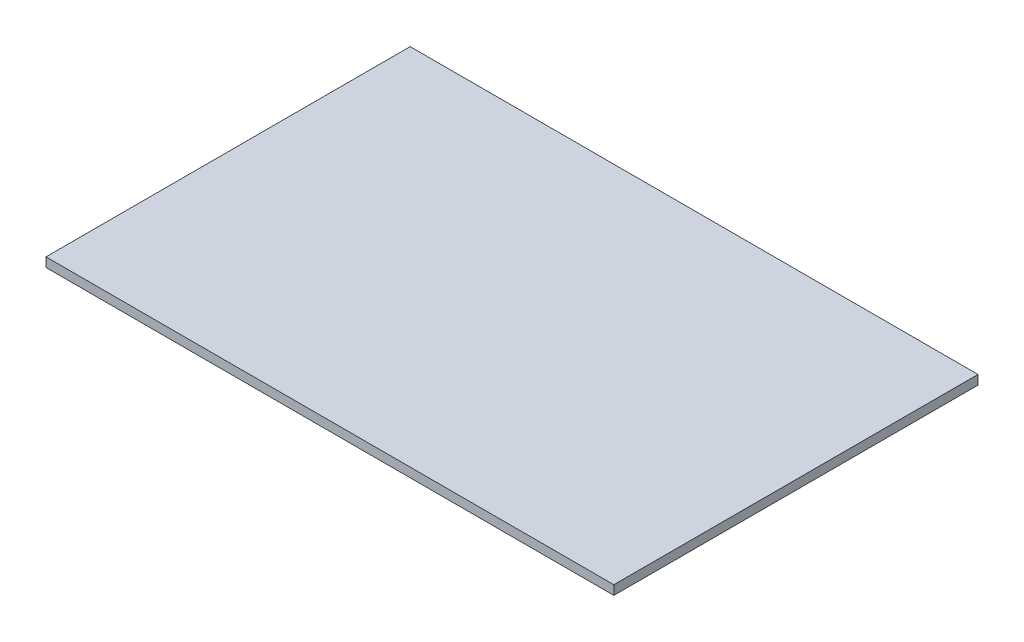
ISO-10303-21;
HEADER;
FILE_DESCRIPTION(('STEP AP214'),'2;1');
FILE_NAME('part.step','',(''),(''),'','','');
FILE_SCHEMA(('AUTOMOTIVE_DESIGN { 1 0 10303 214 1 1 1 1 }'));
ENDSEC;
DATA;
#1=APPLICATION_CONTEXT('core data for automotive mechanical design processes');
#2=APPLICATION_PROTOCOL_DEFINITION('international standard','automotive_design',2000,#1);
#3=PRODUCT_CONTEXT('',#1,'mechanical');
#4=PRODUCT('Part','Part','',(#3));
#5=PRODUCT_RELATED_PRODUCT_CATEGORY('part','',(#4));
#6=PRODUCT_DEFINITION_FORMATION('','',#4);
#7=PRODUCT_DEFINITION_CONTEXT('part definition',#1,'design');
#8=PRODUCT_DEFINITION('design','',#6,#7);
#9=PRODUCT_DEFINITION_SHAPE('','',#8);
#10=(LENGTH_UNIT() NAMED_UNIT(*) SI_UNIT(.MILLI.,.METRE.));
#11=(NAMED_UNIT(*) PLANE_ANGLE_UNIT() SI_UNIT($,.RADIAN.));
#12=(NAMED_UNIT(*) SI_UNIT($,.STERADIAN.) SOLID_ANGLE_UNIT());
#13=UNCERTAINTY_MEASURE_WITH_UNIT(LENGTH_MEASURE(1.E-05),#10,'distance_accuracy_value','');
#14=(GEOMETRIC_REPRESENTATION_CONTEXT(3) GLOBAL_UNCERTAINTY_ASSIGNED_CONTEXT((#13)) GLOBAL_UNIT_ASSIGNED_CONTEXT((#10,
#11,#12)) REPRESENTATION_CONTEXT('',''));
#15=CARTESIAN_POINT('',(0.,0.,0.));
#16=DIRECTION('',(0.,0.,1.));
#17=DIRECTION('',(1.,0.,0.));
#18=AXIS2_PLACEMENT_3D('',#15,#16,#17);
#19=CARTESIAN_POINT('',(0.,19.05,0.));
#20=DIRECTION('',(1.,0.,0.));
#21=DIRECTION('',(0.,0.,-1.));
#22=AXIS2_PLACEMENT_3D('',#19,#20,#21);
#23=PLANE('',#22);
#24=DIRECTION('',(0.,0.,1.));
#25=VECTOR('',#24,1.);
#26=CARTESIAN_POINT('',(0.,0.,0.));
#27=LINE('',#26,#25);
#28=CARTESIAN_POINT('',(0.,0.,-749.3));
#29=VERTEX_POINT('',#28);
#30=CARTESIAN_POINT('',(0.,0.,0.));
#31=VERTEX_POINT('',#30);
#32=EDGE_CURVE('E102',#29,#31,#27,.T.);
#33=ORIENTED_EDGE('',*,*,#32,.T.);
#34=DIRECTION('',(0.,-1.,0.));
#35=VECTOR('',#34,1.);
#36=CARTESIAN_POINT('',(0.,19.05,0.));
#37=LINE('',#36,#35);
#38=CARTESIAN_POINT('',(0.,19.05,0.));
#39=VERTEX_POINT('',#38);
#40=EDGE_CURVE('E11',#39,#31,#37,.T.);
#41=ORIENTED_EDGE('',*,*,#40,.F.);
#42=DIRECTION('',(0.,0.,1.));
#43=VECTOR('',#42,1.);
#44=CARTESIAN_POINT('',(0.,19.05,0.));
#45=LINE('',#44,#43);
#46=CARTESIAN_POINT('',(0.,19.05,-749.3));
#47=VERTEX_POINT('',#46);
#48=EDGE_CURVE('E90',#47,#39,#45,.T.);
#49=ORIENTED_EDGE('',*,*,#48,.F.);
#50=DIRECTION('',(0.,-1.,0.));
#51=VECTOR('',#50,1.);
#52=CARTESIAN_POINT('',(0.,19.05,-749.3));
#53=LINE('',#52,#51);
#54=EDGE_CURVE('E98',#47,#29,#53,.T.);
#55=ORIENTED_EDGE('',*,*,#54,.T.);
#56=EDGE_LOOP('',(#33,#41,#49,#55));
#57=FACE_BOUND('',#56,.T.);
#58=ADVANCED_FACE('F39',(#57),#23,.F.);
#59=CARTESIAN_POINT('',(0.,19.05,0.));
#60=DIRECTION('',(0.,0.,-1.));
#61=DIRECTION('',(-1.,0.,0.));
#62=AXIS2_PLACEMENT_3D('',#59,#60,#61);
#63=PLANE('',#62);
#64=DIRECTION('',(1.,0.,0.));
#65=VECTOR('',#64,1.);
#66=CARTESIAN_POINT('',(0.,0.,0.));
#67=LINE('',#66,#65);
#68=CARTESIAN_POINT('',(1168.4,0.,0.));
#69=VERTEX_POINT('',#68);
#70=EDGE_CURVE('E94',#31,#69,#67,.T.);
#71=ORIENTED_EDGE('',*,*,#70,.T.);
#72=DIRECTION('',(0.,-1.,0.));
#73=VECTOR('',#72,1.);
#74=CARTESIAN_POINT('',(1168.4,19.05,0.));
#75=LINE('',#74,#73);
#76=CARTESIAN_POINT('',(1168.4,19.05,0.));
#77=VERTEX_POINT('',#76);
#78=EDGE_CURVE('E47',#77,#69,#75,.T.);
#79=ORIENTED_EDGE('',*,*,#78,.F.);
#80=DIRECTION('',(1.,0.,0.));
#81=VECTOR('',#80,1.);
#82=CARTESIAN_POINT('',(0.,19.05,0.));
#83=LINE('',#82,#81);
#84=EDGE_CURVE('E85',#39,#77,#83,.T.);
#85=ORIENTED_EDGE('',*,*,#84,.F.);
#86=ORIENTED_EDGE('',*,*,#40,.T.);
#87=EDGE_LOOP('',(#71,#79,#85,#86));
#88=FACE_BOUND('',#87,.T.);
#89=ADVANCED_FACE('F93',(#88),#63,.F.);
#90=CARTESIAN_POINT('',(1168.4,19.05,0.));
#91=DIRECTION('',(-1.,0.,0.));
#92=DIRECTION('',(0.,0.,1.));
#93=AXIS2_PLACEMENT_3D('',#90,#91,#92);
#94=PLANE('',#93);
#95=DIRECTION('',(0.,0.,-1.));
#96=VECTOR('',#95,1.);
#97=CARTESIAN_POINT('',(1168.4,0.,0.));
#98=LINE('',#97,#96);
#99=CARTESIAN_POINT('',(1168.4,0.,-749.3));
#100=VERTEX_POINT('',#99);
#101=EDGE_CURVE('E72',#69,#100,#98,.T.);
#102=ORIENTED_EDGE('',*,*,#101,.T.);
#103=DIRECTION('',(0.,-1.,0.));
#104=VECTOR('',#103,1.);
#105=CARTESIAN_POINT('',(1168.4,19.05,-749.3));
#106=LINE('',#105,#104);
#107=CARTESIAN_POINT('',(1168.4,19.05,-749.3));
#108=VERTEX_POINT('',#107);
#109=EDGE_CURVE('E95',#108,#100,#106,.T.);
#110=ORIENTED_EDGE('',*,*,#109,.F.);
#111=DIRECTION('',(0.,0.,-1.));
#112=VECTOR('',#111,1.);
#113=CARTESIAN_POINT('',(1168.4,19.05,0.));
#114=LINE('',#113,#112);
#115=EDGE_CURVE('E88',#77,#108,#114,.T.);
#116=ORIENTED_EDGE('',*,*,#115,.F.);
#117=ORIENTED_EDGE('',*,*,#78,.T.);
#118=EDGE_LOOP('',(#102,#110,#116,#117));
#119=FACE_BOUND('',#118,.T.);
#120=ADVANCED_FACE('F96',(#119),#94,.F.);
#121=CARTESIAN_POINT('',(0.,19.05,-749.3));
#122=DIRECTION('',(0.,0.,1.));
#123=DIRECTION('',(1.,0.,0.));
#124=AXIS2_PLACEMENT_3D('',#121,#122,#123);
#125=PLANE('',#124);
#126=DIRECTION('',(-1.,0.,0.));
#127=VECTOR('',#126,1.);
#128=CARTESIAN_POINT('',(0.,0.,-749.3));
#129=LINE('',#128,#127);
#130=EDGE_CURVE('E78',#100,#29,#129,.T.);
#131=ORIENTED_EDGE('',*,*,#130,.T.);
#132=ORIENTED_EDGE('',*,*,#54,.F.);
#133=DIRECTION('',(-1.,0.,0.));
#134=VECTOR('',#133,1.);
#135=CARTESIAN_POINT('',(0.,19.05,-749.3));
#136=LINE('',#135,#134);
#137=EDGE_CURVE('E55',#108,#47,#136,.T.);
#138=ORIENTED_EDGE('',*,*,#137,.F.);
#139=ORIENTED_EDGE('',*,*,#109,.T.);
#140=EDGE_LOOP('',(#131,#132,#138,#139));
#141=FACE_BOUND('',#140,.T.);
#142=ADVANCED_FACE('F109',(#141),#125,.F.);
#143=CARTESIAN_POINT('',(0.,19.05,0.));
#144=DIRECTION('',(0.,-1.,0.));
#145=DIRECTION('',(0.,0.,-1.));
#146=AXIS2_PLACEMENT_3D('',#143,#144,#145);
#147=PLANE('',#146);
#148=ORIENTED_EDGE('',*,*,#48,.T.);
#149=ORIENTED_EDGE('',*,*,#84,.T.);
#150=ORIENTED_EDGE('',*,*,#115,.T.);
#151=ORIENTED_EDGE('',*,*,#137,.T.);
#152=EDGE_LOOP('',(#148,#149,#150,#151));
#153=FACE_BOUND('',#152,.T.);
#154=ADVANCED_FACE('F86',(#153),#147,.F.);
#155=CARTESIAN_POINT('',(0.,0.,0.));
#156=DIRECTION('',(0.,-1.,0.));
#157=DIRECTION('',(0.,0.,-1.));
#158=AXIS2_PLACEMENT_3D('',#155,#156,#157);
#159=PLANE('',#158);
#160=ORIENTED_EDGE('',*,*,#32,.F.);
#161=ORIENTED_EDGE('',*,*,#130,.F.);
#162=ORIENTED_EDGE('',*,*,#101,.F.);
#163=ORIENTED_EDGE('',*,*,#70,.F.);
#164=EDGE_LOOP('',(#160,#161,#162,#163));
#165=FACE_BOUND('',#164,.T.);
#166=ADVANCED_FACE('F112',(#165),#159,.T.);
#167=CLOSED_SHELL('',(#58,#89,#120,#142,#154,#166));
#168=MANIFOLD_SOLID_BREP('B2',#167);
#169=ADVANCED_BREP_SHAPE_REPRESENTATION('',(#18,#168),#14);
#170=SHAPE_DEFINITION_REPRESENTATION(#9,#169);
ENDSEC;
END-ISO-10303-21;
